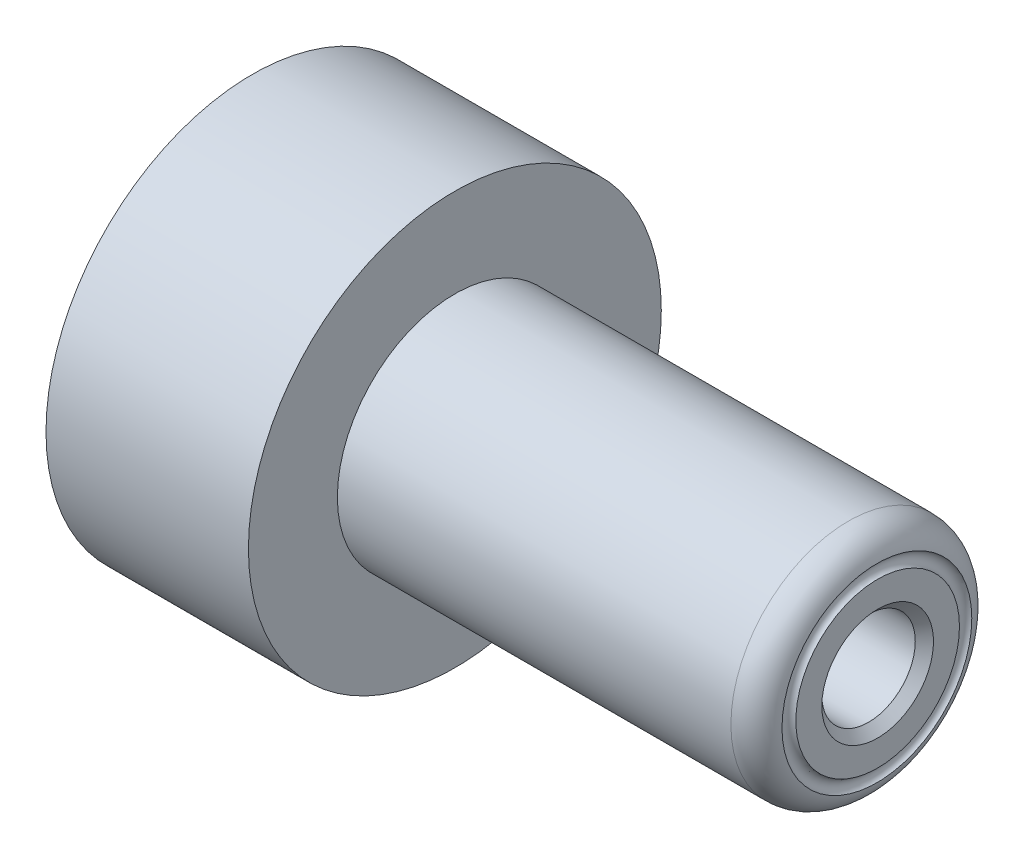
ISO-10303-21;
HEADER;
FILE_DESCRIPTION(('STEP AP214'),'2;1');
FILE_NAME('part.step','',(''),(''),'','','');
FILE_SCHEMA(('AUTOMOTIVE_DESIGN { 1 0 10303 214 1 1 1 1 }'));
ENDSEC;
DATA;
#1=APPLICATION_CONTEXT('core data for automotive mechanical design processes');
#2=APPLICATION_PROTOCOL_DEFINITION('international standard','automotive_design',2000,#1);
#3=PRODUCT_CONTEXT('',#1,'mechanical');
#4=PRODUCT('Part','Part','',(#3));
#5=PRODUCT_RELATED_PRODUCT_CATEGORY('part','',(#4));
#6=PRODUCT_DEFINITION_FORMATION('','',#4);
#7=PRODUCT_DEFINITION_CONTEXT('part definition',#1,'design');
#8=PRODUCT_DEFINITION('design','',#6,#7);
#9=PRODUCT_DEFINITION_SHAPE('','',#8);
#10=(LENGTH_UNIT() NAMED_UNIT(*) SI_UNIT(.MILLI.,.METRE.));
#11=(NAMED_UNIT(*) PLANE_ANGLE_UNIT() SI_UNIT($,.RADIAN.));
#12=(NAMED_UNIT(*) SI_UNIT($,.STERADIAN.) SOLID_ANGLE_UNIT());
#13=UNCERTAINTY_MEASURE_WITH_UNIT(LENGTH_MEASURE(1.E-05),#10,'distance_accuracy_value','');
#14=(GEOMETRIC_REPRESENTATION_CONTEXT(3) GLOBAL_UNCERTAINTY_ASSIGNED_CONTEXT((#13)) GLOBAL_UNIT_ASSIGNED_CONTEXT((#10,
#11,#12)) REPRESENTATION_CONTEXT('',''));
#15=CARTESIAN_POINT('',(0.,0.,0.));
#16=DIRECTION('',(0.,0.,1.));
#17=DIRECTION('',(1.,0.,0.));
#18=AXIS2_PLACEMENT_3D('',#15,#16,#17);
#19=CARTESIAN_POINT('',(33.655,4.7498,0.));
#20=DIRECTION('',(-1.,0.,0.));
#21=DIRECTION('',(0.,0.,1.));
#22=AXIS2_PLACEMENT_3D('',#19,#20,#21);
#23=PLANE('',#22);
#24=CARTESIAN_POINT('',(33.655,0.,0.));
#25=DIRECTION('',(-1.,0.,0.));
#26=DIRECTION('',(0.,0.,1.));
#27=AXIS2_PLACEMENT_3D('',#24,#25,#26);
#28=CIRCLE('',#27,3.005);
#29=CARTESIAN_POINT('',(33.655,0.,3.005));
#30=VERTEX_POINT('',#29);
#31=EDGE_CURVE('E10',#30,#30,#28,.T.);
#32=ORIENTED_EDGE('',*,*,#31,.T.);
#33=EDGE_LOOP('',(#32));
#34=FACE_BOUND('',#33,.T.);
#35=CARTESIAN_POINT('',(33.655,0.,0.));
#36=DIRECTION('',(1.,0.,0.));
#37=DIRECTION('',(0.,0.,-1.));
#38=AXIS2_PLACEMENT_3D('',#35,#36,#37);
#39=CIRCLE('',#38,4.4044004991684);
#40=CARTESIAN_POINT('',(33.655,0.,-4.4044004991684));
#41=VERTEX_POINT('',#40);
#42=EDGE_CURVE('E78',#41,#41,#39,.F.);
#43=ORIENTED_EDGE('',*,*,#42,.F.);
#44=EDGE_LOOP('',(#43));
#45=FACE_BOUND('',#44,.T.);
#46=ADVANCED_FACE('F31',(#34,#45),#23,.F.);
#47=CARTESIAN_POINT('',(32.0802,0.,0.));
#48=DIRECTION('',(-1.,0.,0.));
#49=DIRECTION('',(0.,0.,1.));
#50=AXIS2_PLACEMENT_3D('',#47,#48,#49);
#51=TOROIDAL_SURFACE('',#50,4.7498,1.5748);
#52=CARTESIAN_POINT('',(32.0802,0.,0.));
#53=DIRECTION('',(-1.,0.,0.));
#54=DIRECTION('',(0.,0.,1.));
#55=AXIS2_PLACEMENT_3D('',#52,#53,#54);
#56=CIRCLE('',#55,6.3246);
#57=CARTESIAN_POINT('',(32.0802,0.,6.3246));
#58=VERTEX_POINT('',#57);
#59=EDGE_CURVE('E48',#58,#58,#56,.T.);
#60=ORIENTED_EDGE('',*,*,#59,.F.);
#61=EDGE_LOOP('',(#60));
#62=FACE_BOUND('',#61,.T.);
#63=CARTESIAN_POINT('',(33.6135607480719,0.,0.));
#64=DIRECTION('',(1.,0.,0.));
#65=DIRECTION('',(0.,0.,-1.));
#66=AXIS2_PLACEMENT_3D('',#63,#64,#65);
#67=CIRCLE('',#66,5.10868696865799);
#68=CARTESIAN_POINT('',(33.6135607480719,0.,-5.10868696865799));
#69=VERTEX_POINT('',#68);
#70=EDGE_CURVE('E35',#69,#69,#67,.T.);
#71=ORIENTED_EDGE('',*,*,#70,.F.);
#72=EDGE_LOOP('',(#71));
#73=FACE_BOUND('',#72,.T.);
#74=ADVANCED_FACE('F87',(#62,#73),#51,.T.);
#75=CARTESIAN_POINT('',(0.,0.,0.));
#76=DIRECTION('',(-1.,0.,0.));
#77=DIRECTION('',(0.,0.,1.));
#78=AXIS2_PLACEMENT_3D('',#75,#76,#77);
#79=CYLINDRICAL_SURFACE('',#78,3.9751);
#80=CARTESIAN_POINT('',(21.8948,0.,0.));
#81=DIRECTION('',(-1.,0.,0.));
#82=DIRECTION('',(0.,0.,1.));
#83=AXIS2_PLACEMENT_3D('',#80,#81,#82);
#84=CIRCLE('',#83,3.9751);
#85=CARTESIAN_POINT('',(21.8948,0.,3.9751));
#86=VERTEX_POINT('',#85);
#87=EDGE_CURVE('E43',#86,#86,#84,.T.);
#88=ORIENTED_EDGE('',*,*,#87,.F.);
#89=EDGE_LOOP('',(#88));
#90=FACE_BOUND('',#89,.T.);
#91=CARTESIAN_POINT('',(0.,0.,0.));
#92=DIRECTION('',(-1.,0.,0.));
#93=DIRECTION('',(0.,0.,1.));
#94=AXIS2_PLACEMENT_3D('',#91,#92,#93);
#95=CIRCLE('',#94,3.9751);
#96=CARTESIAN_POINT('',(0.,0.,3.9751));
#97=VERTEX_POINT('',#96);
#98=EDGE_CURVE('E60',#97,#97,#95,.T.);
#99=ORIENTED_EDGE('',*,*,#98,.T.);
#100=EDGE_LOOP('',(#99));
#101=FACE_BOUND('',#100,.T.);
#102=ADVANCED_FACE('F89',(#90,#101),#79,.F.);
#103=CARTESIAN_POINT('',(21.8948,3.9751,0.));
#104=DIRECTION('',(1.,0.,0.));
#105=DIRECTION('',(0.,0.,-1.));
#106=AXIS2_PLACEMENT_3D('',#103,#104,#105);
#107=PLANE('',#106);
#108=CARTESIAN_POINT('',(21.8948,0.,0.));
#109=DIRECTION('',(1.,0.,0.));
#110=DIRECTION('',(0.,0.,-1.));
#111=AXIS2_PLACEMENT_3D('',#108,#109,#110);
#112=CIRCLE('',#111,2.515);
#113=CARTESIAN_POINT('',(21.8948,0.,-2.515));
#114=VERTEX_POINT('',#113);
#115=EDGE_CURVE('E73',#114,#114,#112,.T.);
#116=ORIENTED_EDGE('',*,*,#115,.T.);
#117=EDGE_LOOP('',(#116));
#118=FACE_BOUND('',#117,.T.);
#119=ORIENTED_EDGE('',*,*,#87,.T.);
#120=EDGE_LOOP('',(#119));
#121=FACE_BOUND('',#120,.T.);
#122=ADVANCED_FACE('F96',(#118,#121),#107,.F.);
#123=CARTESIAN_POINT('',(0.,0.,0.));
#124=DIRECTION('',(-1.,0.,0.));
#125=DIRECTION('',(0.,0.,1.));
#126=AXIS2_PLACEMENT_3D('',#123,#124,#125);
#127=CYLINDRICAL_SURFACE('',#126,6.3246);
#128=CARTESIAN_POINT('',(10.8966,0.,0.));
#129=DIRECTION('',(-1.,0.,0.));
#130=DIRECTION('',(0.,0.,1.));
#131=AXIS2_PLACEMENT_3D('',#128,#129,#130);
#132=CIRCLE('',#131,6.3246);
#133=CARTESIAN_POINT('',(10.8966,0.,6.3246));
#134=VERTEX_POINT('',#133);
#135=EDGE_CURVE('E51',#134,#134,#132,.T.);
#136=ORIENTED_EDGE('',*,*,#135,.F.);
#137=EDGE_LOOP('',(#136));
#138=FACE_BOUND('',#137,.T.);
#139=ORIENTED_EDGE('',*,*,#59,.T.);
#140=EDGE_LOOP('',(#139));
#141=FACE_BOUND('',#140,.T.);
#142=ADVANCED_FACE('F101',(#138,#141),#127,.T.);
#143=CARTESIAN_POINT('',(10.8966,11.1125,0.));
#144=DIRECTION('',(-1.,0.,0.));
#145=DIRECTION('',(0.,0.,1.));
#146=AXIS2_PLACEMENT_3D('',#143,#144,#145);
#147=PLANE('',#146);
#148=CARTESIAN_POINT('',(10.8966,0.,0.));
#149=DIRECTION('',(-1.,0.,0.));
#150=DIRECTION('',(0.,0.,1.));
#151=AXIS2_PLACEMENT_3D('',#148,#149,#150);
#152=CIRCLE('',#151,11.1125);
#153=CARTESIAN_POINT('',(10.8966,0.,11.1125));
#154=VERTEX_POINT('',#153);
#155=EDGE_CURVE('E54',#154,#154,#152,.T.);
#156=ORIENTED_EDGE('',*,*,#155,.F.);
#157=EDGE_LOOP('',(#156));
#158=FACE_BOUND('',#157,.T.);
#159=ORIENTED_EDGE('',*,*,#135,.T.);
#160=EDGE_LOOP('',(#159));
#161=FACE_BOUND('',#160,.T.);
#162=ADVANCED_FACE('F109',(#158,#161),#147,.F.);
#163=CARTESIAN_POINT('',(0.,0.,0.));
#164=DIRECTION('',(-1.,0.,0.));
#165=DIRECTION('',(0.,0.,1.));
#166=AXIS2_PLACEMENT_3D('',#163,#164,#165);
#167=CYLINDRICAL_SURFACE('',#166,11.1125);
#168=CARTESIAN_POINT('',(0.,0.,0.));
#169=DIRECTION('',(-1.,0.,0.));
#170=DIRECTION('',(0.,0.,1.));
#171=AXIS2_PLACEMENT_3D('',#168,#169,#170);
#172=CIRCLE('',#171,11.1125);
#173=CARTESIAN_POINT('',(0.,0.,11.1125));
#174=VERTEX_POINT('',#173);
#175=EDGE_CURVE('E57',#174,#174,#172,.T.);
#176=ORIENTED_EDGE('',*,*,#175,.F.);
#177=EDGE_LOOP('',(#176));
#178=FACE_BOUND('',#177,.T.);
#179=ORIENTED_EDGE('',*,*,#155,.T.);
#180=EDGE_LOOP('',(#179));
#181=FACE_BOUND('',#180,.T.);
#182=ADVANCED_FACE('F121',(#178,#181),#167,.T.);
#183=CARTESIAN_POINT('',(0.,3.9751,0.));
#184=DIRECTION('',(1.,0.,0.));
#185=DIRECTION('',(0.,0.,-1.));
#186=AXIS2_PLACEMENT_3D('',#183,#184,#185);
#187=PLANE('',#186);
#188=CARTESIAN_POINT('',(0.,0.,6.7437));
#189=DIRECTION('',(-1.,0.,0.));
#190=DIRECTION('',(0.,0.,-1.));
#191=AXIS2_PLACEMENT_3D('',#188,#189,#190);
#192=CIRCLE('',#191,1.2065);
#193=CARTESIAN_POINT('',(0.,0.,5.5372));
#194=VERTEX_POINT('',#193);
#195=EDGE_CURVE('E70',#194,#194,#192,.T.);
#196=ORIENTED_EDGE('',*,*,#195,.F.);
#197=EDGE_LOOP('',(#196));
#198=FACE_BOUND('',#197,.T.);
#199=CARTESIAN_POINT('',(0.,0.,-6.7437));
#200=DIRECTION('',(-1.,0.,0.));
#201=DIRECTION('',(0.,0.,1.));
#202=AXIS2_PLACEMENT_3D('',#199,#200,#201);
#203=CIRCLE('',#202,1.2065);
#204=CARTESIAN_POINT('',(0.,0.,-5.5372));
#205=VERTEX_POINT('',#204);
#206=EDGE_CURVE('E64',#205,#205,#203,.T.);
#207=ORIENTED_EDGE('',*,*,#206,.F.);
#208=EDGE_LOOP('',(#207));
#209=FACE_BOUND('',#208,.T.);
#210=ORIENTED_EDGE('',*,*,#98,.F.);
#211=EDGE_LOOP('',(#210));
#212=FACE_BOUND('',#211,.T.);
#213=ORIENTED_EDGE('',*,*,#175,.T.);
#214=EDGE_LOOP('',(#213));
#215=FACE_BOUND('',#214,.T.);
#216=ADVANCED_FACE('F117',(#198,#209,#212,#215),#187,.F.);
#217=CARTESIAN_POINT('',(2.54,0.,-6.7437));
#218=DIRECTION('',(-1.,0.,0.));
#219=DIRECTION('',(0.,0.,1.));
#220=AXIS2_PLACEMENT_3D('',#217,#218,#219);
#221=CYLINDRICAL_SURFACE('',#220,1.2065);
#222=CARTESIAN_POINT('',(2.54,0.,-6.7437));
#223=DIRECTION('',(-1.,0.,0.));
#224=DIRECTION('',(0.,0.,1.));
#225=AXIS2_PLACEMENT_3D('',#222,#223,#224);
#226=CIRCLE('',#225,1.2065);
#227=CARTESIAN_POINT('',(2.54,0.,-5.5372));
#228=VERTEX_POINT('',#227);
#229=EDGE_CURVE('E63',#228,#228,#226,.T.);
#230=ORIENTED_EDGE('',*,*,#229,.F.);
#231=EDGE_LOOP('',(#230));
#232=FACE_BOUND('',#231,.T.);
#233=ORIENTED_EDGE('',*,*,#206,.T.);
#234=EDGE_LOOP('',(#233));
#235=FACE_BOUND('',#234,.T.);
#236=ADVANCED_FACE('F120',(#232,#235),#221,.F.);
#237=CARTESIAN_POINT('',(2.54,0.,-6.7437));
#238=DIRECTION('',(-1.,0.,0.));
#239=DIRECTION('',(0.,0.,1.));
#240=AXIS2_PLACEMENT_3D('',#237,#238,#239);
#241=PLANE('',#240);
#242=ORIENTED_EDGE('',*,*,#229,.T.);
#243=EDGE_LOOP('',(#242));
#244=FACE_BOUND('',#243,.T.);
#245=ADVANCED_FACE('F140',(#244),#241,.T.);
#246=CARTESIAN_POINT('',(2.54,0.,6.7437));
#247=DIRECTION('',(-1.,0.,0.));
#248=DIRECTION('',(0.,0.,1.));
#249=AXIS2_PLACEMENT_3D('',#246,#247,#248);
#250=CYLINDRICAL_SURFACE('',#249,1.2065);
#251=CARTESIAN_POINT('',(2.54,0.,6.7437));
#252=DIRECTION('',(-1.,0.,0.));
#253=DIRECTION('',(0.,0.,-1.));
#254=AXIS2_PLACEMENT_3D('',#251,#252,#253);
#255=CIRCLE('',#254,1.2065);
#256=CARTESIAN_POINT('',(2.54,0.,5.5372));
#257=VERTEX_POINT('',#256);
#258=EDGE_CURVE('E67',#257,#257,#255,.T.);
#259=ORIENTED_EDGE('',*,*,#258,.F.);
#260=EDGE_LOOP('',(#259));
#261=FACE_BOUND('',#260,.T.);
#262=ORIENTED_EDGE('',*,*,#195,.T.);
#263=EDGE_LOOP('',(#262));
#264=FACE_BOUND('',#263,.T.);
#265=ADVANCED_FACE('F144',(#261,#264),#250,.F.);
#266=CARTESIAN_POINT('',(2.54,0.,6.7437));
#267=DIRECTION('',(1.,0.,0.));
#268=DIRECTION('',(0.,0.,-1.));
#269=AXIS2_PLACEMENT_3D('',#266,#267,#268);
#270=PLANE('',#269);
#271=ORIENTED_EDGE('',*,*,#258,.T.);
#272=EDGE_LOOP('',(#271));
#273=FACE_BOUND('',#272,.T.);
#274=ADVANCED_FACE('F148',(#273),#270,.F.);
#275=CARTESIAN_POINT('',(0.,0.,0.));
#276=DIRECTION('',(1.,0.,0.));
#277=DIRECTION('',(0.,0.,-1.));
#278=AXIS2_PLACEMENT_3D('',#275,#276,#277);
#279=CYLINDRICAL_SURFACE('',#278,2.515);
#280=CARTESIAN_POINT('',(33.165,0.,0.));
#281=DIRECTION('',(-1.,0.,0.));
#282=DIRECTION('',(0.,0.,1.));
#283=AXIS2_PLACEMENT_3D('',#280,#281,#282);
#284=CIRCLE('',#283,2.515);
#285=CARTESIAN_POINT('',(33.165,0.,2.515));
#286=VERTEX_POINT('',#285);
#287=EDGE_CURVE('E39',#286,#286,#284,.F.);
#288=ORIENTED_EDGE('',*,*,#287,.T.);
#289=EDGE_LOOP('',(#288));
#290=FACE_BOUND('',#289,.T.);
#291=ORIENTED_EDGE('',*,*,#115,.F.);
#292=EDGE_LOOP('',(#291));
#293=FACE_BOUND('',#292,.T.);
#294=ADVANCED_FACE('F152',(#290,#293),#279,.F.);
#295=CARTESIAN_POINT('',(33.165,0.,0.));
#296=DIRECTION('',(1.,0.,0.));
#297=DIRECTION('',(0.,0.,-1.));
#298=AXIS2_PLACEMENT_3D('',#295,#296,#297);
#299=CONICAL_SURFACE('',#298,2.515,0.785398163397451);
#300=ORIENTED_EDGE('',*,*,#31,.F.);
#301=EDGE_LOOP('',(#300));
#302=FACE_BOUND('',#301,.T.);
#303=ORIENTED_EDGE('',*,*,#287,.F.);
#304=EDGE_LOOP('',(#303));
#305=FACE_BOUND('',#304,.T.);
#306=ADVANCED_FACE('F33',(#302,#305),#299,.F.);
#307=CARTESIAN_POINT('',(33.778,0.,0.));
#308=DIRECTION('',(-1.,0.,0.));
#309=DIRECTION('',(0.,0.,1.));
#310=AXIS2_PLACEMENT_3D('',#307,#308,#309);
#311=TOROIDAL_SURFACE('',#310,4.765,0.381000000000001);
#312=ORIENTED_EDGE('',*,*,#70,.T.);
#313=EDGE_LOOP('',(#312));
#314=FACE_BOUND('',#313,.T.);
#315=ORIENTED_EDGE('',*,*,#42,.T.);
#316=EDGE_LOOP('',(#315));
#317=FACE_BOUND('',#316,.T.);
#318=ADVANCED_FACE('F85',(#314,#317),#311,.F.);
#319=CLOSED_SHELL('',(#46,#74,#102,#122,#142,#162,#182,#216,#236,#245,#265,#274,#294,#306,#318));
#320=MANIFOLD_SOLID_BREP('B2',#319);
#321=ADVANCED_BREP_SHAPE_REPRESENTATION('',(#18,#320),#14);
#322=SHAPE_DEFINITION_REPRESENTATION(#9,#321);
ENDSEC;
END-ISO-10303-21;
